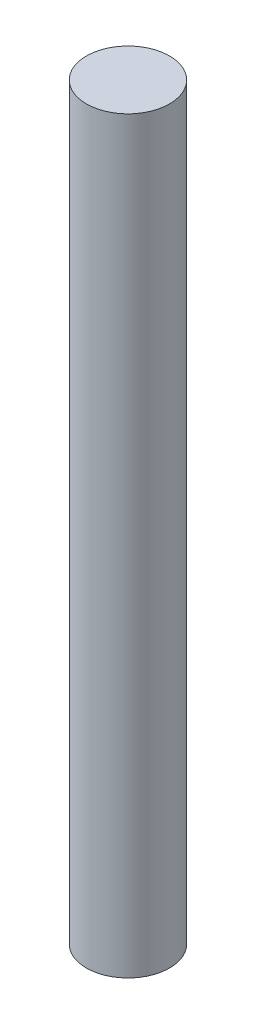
ISO-10303-21;
HEADER;
FILE_DESCRIPTION(('STEP AP214'),'2;1');
FILE_NAME('part.step','',(''),(''),'','','');
FILE_SCHEMA(('AUTOMOTIVE_DESIGN { 1 0 10303 214 1 1 1 1 }'));
ENDSEC;
DATA;
#1=APPLICATION_CONTEXT('core data for automotive mechanical design processes');
#2=APPLICATION_PROTOCOL_DEFINITION('international standard','automotive_design',2000,#1);
#3=PRODUCT_CONTEXT('',#1,'mechanical');
#4=PRODUCT('Part','Part','',(#3));
#5=PRODUCT_RELATED_PRODUCT_CATEGORY('part','',(#4));
#6=PRODUCT_DEFINITION_FORMATION('','',#4);
#7=PRODUCT_DEFINITION_CONTEXT('part definition',#1,'design');
#8=PRODUCT_DEFINITION('design','',#6,#7);
#9=PRODUCT_DEFINITION_SHAPE('','',#8);
#10=(LENGTH_UNIT() NAMED_UNIT(*) SI_UNIT(.MILLI.,.METRE.));
#11=(NAMED_UNIT(*) PLANE_ANGLE_UNIT() SI_UNIT($,.RADIAN.));
#12=(NAMED_UNIT(*) SI_UNIT($,.STERADIAN.) SOLID_ANGLE_UNIT());
#13=UNCERTAINTY_MEASURE_WITH_UNIT(LENGTH_MEASURE(1.E-05),#10,'distance_accuracy_value','');
#14=(GEOMETRIC_REPRESENTATION_CONTEXT(3) GLOBAL_UNCERTAINTY_ASSIGNED_CONTEXT((#13)) GLOBAL_UNIT_ASSIGNED_CONTEXT((#10,
#11,#12)) REPRESENTATION_CONTEXT('',''));
#15=CARTESIAN_POINT('',(0.,0.,0.));
#16=DIRECTION('',(0.,0.,1.));
#17=DIRECTION('',(1.,0.,0.));
#18=AXIS2_PLACEMENT_3D('',#15,#16,#17);
#19=CARTESIAN_POINT('',(0.,436.88,0.));
#20=DIRECTION('',(0.,-1.,0.));
#21=DIRECTION('',(0.,0.,-1.));
#22=AXIS2_PLACEMENT_3D('',#19,#20,#21);
#23=CYLINDRICAL_SURFACE('',#22,24.257);
#24=CARTESIAN_POINT('',(0.,436.88,0.));
#25=DIRECTION('',(0.,1.,0.));
#26=DIRECTION('',(0.,0.,1.));
#27=AXIS2_PLACEMENT_3D('',#24,#25,#26);
#28=CIRCLE('',#27,24.257);
#29=CARTESIAN_POINT('',(0.,436.88,24.257));
#30=VERTEX_POINT('',#29);
#31=EDGE_CURVE('E10',#30,#30,#28,.T.);
#32=ORIENTED_EDGE('',*,*,#31,.F.);
#33=EDGE_LOOP('',(#32));
#34=FACE_BOUND('',#33,.T.);
#35=CARTESIAN_POINT('',(0.,0.,0.));
#36=DIRECTION('',(0.,1.,0.));
#37=DIRECTION('',(0.,0.,1.));
#38=AXIS2_PLACEMENT_3D('',#35,#36,#37);
#39=CIRCLE('',#38,24.257);
#40=CARTESIAN_POINT('',(0.,0.,24.257));
#41=VERTEX_POINT('',#40);
#42=EDGE_CURVE('E38',#41,#41,#39,.T.);
#43=ORIENTED_EDGE('',*,*,#42,.T.);
#44=EDGE_LOOP('',(#43));
#45=FACE_BOUND('',#44,.T.);
#46=ADVANCED_FACE('F32',(#34,#45),#23,.T.);
#47=CARTESIAN_POINT('',(0.,436.88,0.));
#48=DIRECTION('',(0.,1.,0.));
#49=DIRECTION('',(0.,0.,1.));
#50=AXIS2_PLACEMENT_3D('',#47,#48,#49);
#51=PLANE('',#50);
#52=ORIENTED_EDGE('',*,*,#31,.T.);
#53=EDGE_LOOP('',(#52));
#54=FACE_BOUND('',#53,.T.);
#55=ADVANCED_FACE('F47',(#54),#51,.T.);
#56=CARTESIAN_POINT('',(0.,0.,0.));
#57=DIRECTION('',(0.,1.,0.));
#58=DIRECTION('',(0.,0.,1.));
#59=AXIS2_PLACEMENT_3D('',#56,#57,#58);
#60=PLANE('',#59);
#61=ORIENTED_EDGE('',*,*,#42,.F.);
#62=EDGE_LOOP('',(#61));
#63=FACE_BOUND('',#62,.T.);
#64=ADVANCED_FACE('F45',(#63),#60,.F.);
#65=CLOSED_SHELL('',(#46,#55,#64));
#66=MANIFOLD_SOLID_BREP('B2',#65);
#67=ADVANCED_BREP_SHAPE_REPRESENTATION('',(#18,#66),#14);
#68=SHAPE_DEFINITION_REPRESENTATION(#9,#67);
ENDSEC;
END-ISO-10303-21;
